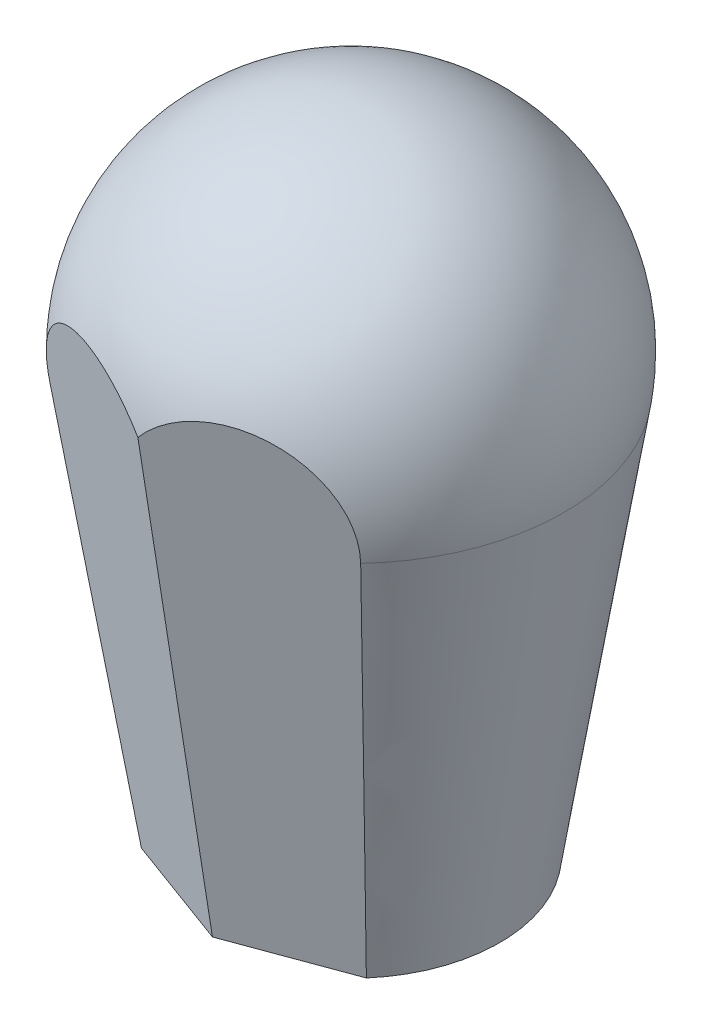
ISO-10303-21;
HEADER;
FILE_DESCRIPTION(('STEP AP214'),'2;1');
FILE_NAME('part.step','',(''),(''),'','','');
FILE_SCHEMA(('AUTOMOTIVE_DESIGN { 1 0 10303 214 1 1 1 1 }'));
ENDSEC;
DATA;
#1=APPLICATION_CONTEXT('core data for automotive mechanical design processes');
#2=APPLICATION_PROTOCOL_DEFINITION('international standard','automotive_design',2000,#1);
#3=PRODUCT_CONTEXT('',#1,'mechanical');
#4=PRODUCT('Part','Part','',(#3));
#5=PRODUCT_RELATED_PRODUCT_CATEGORY('part','',(#4));
#6=PRODUCT_DEFINITION_FORMATION('','',#4);
#7=PRODUCT_DEFINITION_CONTEXT('part definition',#1,'design');
#8=PRODUCT_DEFINITION('design','',#6,#7);
#9=PRODUCT_DEFINITION_SHAPE('','',#8);
#10=(LENGTH_UNIT() NAMED_UNIT(*) SI_UNIT(.MILLI.,.METRE.));
#11=(NAMED_UNIT(*) PLANE_ANGLE_UNIT() SI_UNIT($,.RADIAN.));
#12=(NAMED_UNIT(*) SI_UNIT($,.STERADIAN.) SOLID_ANGLE_UNIT());
#13=UNCERTAINTY_MEASURE_WITH_UNIT(LENGTH_MEASURE(1.E-05),#10,'distance_accuracy_value','');
#14=(GEOMETRIC_REPRESENTATION_CONTEXT(3) GLOBAL_UNCERTAINTY_ASSIGNED_CONTEXT((#13)) GLOBAL_UNIT_ASSIGNED_CONTEXT((#10,
#11,#12)) REPRESENTATION_CONTEXT('',''));
#15=CARTESIAN_POINT('',(0.,0.,0.));
#16=DIRECTION('',(0.,0.,1.));
#17=DIRECTION('',(1.,0.,0.));
#18=AXIS2_PLACEMENT_3D('',#15,#16,#17);
#19=CARTESIAN_POINT('',(0.,24.,0.));
#20=DIRECTION('',(0.,-1.,0.));
#21=DIRECTION('',(0.,0.,-1.));
#22=AXIS2_PLACEMENT_3D('',#19,#20,#21);
#23=PLANE('',#22);
#24=DIRECTION('',(0.938311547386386,0.,0.345791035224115));
#25=VECTOR('',#24,1.);
#26=CARTESIAN_POINT('',(-18.1535039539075,24.,49.259930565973));
#27=LINE('',#26,#25);
#28=CARTESIAN_POINT('',(-45.4115680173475,24.,39.2146591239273));
#29=VERTEX_POINT('',#28);
#30=CARTESIAN_POINT('',(0.,24.,55.9499462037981));
#31=VERTEX_POINT('',#30);
#32=EDGE_CURVE('E49',#29,#31,#27,.T.);
#33=ORIENTED_EDGE('',*,*,#32,.F.);
#34=CARTESIAN_POINT('',(0.,24.,0.));
#35=DIRECTION('',(0.,1.,0.));
#36=DIRECTION('',(0.,0.,1.));
#37=AXIS2_PLACEMENT_3D('',#34,#35,#36);
#38=CIRCLE('',#37,60.);
#39=CARTESIAN_POINT('',(45.4115680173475,24.,39.2146591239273));
#40=VERTEX_POINT('',#39);
#41=EDGE_CURVE('E89',#40,#29,#38,.T.);
#42=ORIENTED_EDGE('',*,*,#41,.F.);
#43=DIRECTION('',(0.938311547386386,0.,-0.345791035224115));
#44=VECTOR('',#43,1.);
#45=CARTESIAN_POINT('',(18.1535039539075,24.,49.259930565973));
#46=LINE('',#45,#44);
#47=EDGE_CURVE('E55',#31,#40,#46,.T.);
#48=ORIENTED_EDGE('',*,*,#47,.F.);
#49=EDGE_LOOP('',(#33,#42,#48));
#50=FACE_BOUND('',#49,.T.);
#51=CARTESIAN_POINT('',(0.,24.,0.));
#52=DIRECTION('',(0.,-1.,0.));
#53=DIRECTION('',(0.,0.,-1.));
#54=AXIS2_PLACEMENT_3D('',#51,#52,#53);
#55=CIRCLE('',#54,41.5692193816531);
#56=CARTESIAN_POINT('',(0.,24.,-41.5692193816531));
#57=VERTEX_POINT('',#56);
#58=EDGE_CURVE('E80',#57,#57,#55,.F.);
#59=ORIENTED_EDGE('',*,*,#58,.T.);
#60=EDGE_LOOP('',(#59));
#61=FACE_BOUND('',#60,.T.);
#62=ADVANCED_FACE('F34',(#50,#61),#23,.T.);
#63=CARTESIAN_POINT('',(0.,201.,0.));
#64=DIRECTION('',(0.,1.,0.));
#65=DIRECTION('',(-1.,0.,0.));
#66=AXIS2_PLACEMENT_3D('',#63,#64,#65);
#67=SPHERICAL_SURFACE('',#66,87.);
#68=CARTESIAN_POINT('',(-26.6756858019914,189.512994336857,72.3850576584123));
#69=DIRECTION('',(0.342020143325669,0.147279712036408,-0.928079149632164));
#70=DIRECTION('',(-0.938311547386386,0.,-0.345791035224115));
#71=AXIS2_PLACEMENT_3D('',#68,#69,#70);
#72=CIRCLE('',#71,38.5468535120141);
#73=CARTESIAN_POINT('',(0.,213.745792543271,86.0612849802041));
#74=VERTEX_POINT('',#73);
#75=CARTESIAN_POINT('',(-62.6765279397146,187.364333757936,58.7768785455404));
#76=VERTEX_POINT('',#75);
#77=EDGE_CURVE('E67',#74,#76,#72,.F.);
#78=ORIENTED_EDGE('',*,*,#77,.F.);
#79=CARTESIAN_POINT('',(26.6756858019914,189.512994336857,72.3850576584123));
#80=DIRECTION('',(-0.342020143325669,0.147279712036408,-0.928079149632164));
#81=DIRECTION('',(-0.938311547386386,0.,0.345791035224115));
#82=AXIS2_PLACEMENT_3D('',#79,#80,#81);
#83=CIRCLE('',#82,38.5468535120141);
#84=CARTESIAN_POINT('',(62.6765279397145,187.364333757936,58.7768785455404));
#85=VERTEX_POINT('',#84);
#86=EDGE_CURVE('E73',#85,#74,#83,.F.);
#87=ORIENTED_EDGE('',*,*,#86,.F.);
#88=CARTESIAN_POINT('',(0.,187.364333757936,0.));
#89=DIRECTION('',(0.,1.,0.));
#90=DIRECTION('',(0.,0.,1.));
#91=AXIS2_PLACEMENT_3D('',#88,#89,#90);
#92=CIRCLE('',#91,85.9247845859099);
#93=EDGE_CURVE('E75',#85,#76,#92,.T.);
#94=ORIENTED_EDGE('',*,*,#93,.T.);
#95=EDGE_LOOP('',(#78,#87,#94));
#96=FACE_BOUND('',#95,.T.);
#97=ADVANCED_FACE('F36',(#96),#67,.T.);
#98=CARTESIAN_POINT('',(0.,187.364333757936,0.));
#99=DIRECTION('',(0.,1.,0.));
#100=DIRECTION('',(0.,0.,1.));
#101=AXIS2_PLACEMENT_3D('',#98,#99,#100);
#102=CONICAL_SURFACE('',#101,85.9247845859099,0.157380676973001);
#103=CARTESIAN_POINT('',(-62.6765489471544,187.364533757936,58.776902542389));
#104=CARTESIAN_POINT('',(-61.3923479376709,175.13860130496,57.3099918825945));
#105=CARTESIAN_POINT('',(-60.1068573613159,162.912745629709,55.8435686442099));
#106=CARTESIAN_POINT('',(-57.5327092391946,138.461223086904,52.9119192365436));
#107=CARTESIAN_POINT('',(-56.2440516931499,126.235556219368,51.4466930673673));
#108=CARTESIAN_POINT('',(-53.6629824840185,101.784453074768,48.5176608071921));
#109=CARTESIAN_POINT('',(-52.3705708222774,89.5590167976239,47.0538547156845));
#110=CARTESIAN_POINT('',(-49.7811975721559,65.1084204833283,44.1279631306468));
#111=CARTESIAN_POINT('',(-48.4842359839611,52.8832604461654,42.6658776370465));
#112=CARTESIAN_POINT('',(-46.8892882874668,37.8818412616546,40.8730343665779));
#113=CARTESIAN_POINT('',(-46.5939545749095,35.1054199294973,40.5412733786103));
#114=CARTESIAN_POINT('',(-46.0029828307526,29.5525957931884,39.877866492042));
#115=CARTESIAN_POINT('',(-45.7073447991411,26.7761929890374,39.5462205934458));
#116=CARTESIAN_POINT('',(-45.4115467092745,23.9998,39.2146352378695));
#117=B_SPLINE_CURVE_WITH_KNOTS('',3,(#103,#104,#105,#106,#107,#108,#109,#110,#111,#112,#113,
#114,#115,#116),.UNSPECIFIED.,.F.,.F.,(4,2,2,2,2,2,4),(0.,37.1412146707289,74.2824326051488,
111.423637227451,148.564840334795,157.000018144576,165.435196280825),.UNSPECIFIED.);
#118=EDGE_CURVE('E78',#76,#29,#117,.T.);
#119=ORIENTED_EDGE('',*,*,#118,.F.);
#120=ORIENTED_EDGE('',*,*,#93,.F.);
#121=CARTESIAN_POINT('',(45.4115467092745,23.9998,39.2146352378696));
#122=CARTESIAN_POINT('',(46.3210073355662,32.5362092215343,40.2341453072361));
#123=CARTESIAN_POINT('',(47.2289806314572,41.072709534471,41.2542179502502));
#124=CARTESIAN_POINT('',(49.0423205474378,58.1458689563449,43.295349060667));
#125=CARTESIAN_POINT('',(49.9476871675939,66.6825280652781,44.3164075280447));
#126=CARTESIAN_POINT('',(52.6604287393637,92.2927061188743,47.3808523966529));
#127=CARTESIAN_POINT('',(54.4644457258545,109.366428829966,49.4255086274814));
#128=CARTESIAN_POINT('',(57.3358374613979,136.594253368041,52.6881962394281));
#129=CARTESIAN_POINT('',(58.4054321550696,146.748221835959,53.9053883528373));
#130=CARTESIAN_POINT('',(60.5425023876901,167.056286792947,56.3405738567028));
#131=CARTESIAN_POINT('',(61.6099779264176,177.21038328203,57.5585672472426));
#132=CARTESIAN_POINT('',(62.6765489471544,187.364533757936,58.7769025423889));
#133=B_SPLINE_CURVE_WITH_KNOTS('',3,(#121,#122,#123,#124,#125,#126,#127,#128,#129,#130,#131,
#132),.UNSPECIFIED.,.F.,.F.,(4,2,2,2,2,4),(0.,25.9351343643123,51.8702680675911,
103.740526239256,134.587859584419,165.43519615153),.UNSPECIFIED.);
#134=EDGE_CURVE('E42',#40,#85,#133,.T.);
#135=ORIENTED_EDGE('',*,*,#134,.F.);
#136=ORIENTED_EDGE('',*,*,#41,.T.);
#137=EDGE_LOOP('',(#119,#120,#135,#136));
#138=FACE_BOUND('',#137,.T.);
#139=ADVANCED_FACE('F98',(#138),#102,.T.);
#140=CARTESIAN_POINT('',(0.,0.,0.));
#141=DIRECTION('',(0.,-1.,0.));
#142=DIRECTION('',(-1.,0.,0.));
#143=AXIS2_PLACEMENT_3D('',#140,#141,#142);
#144=SPHERICAL_SURFACE('',#143,48.);
#145=ORIENTED_EDGE('',*,*,#58,.F.);
#146=EDGE_LOOP('',(#145));
#147=FACE_BOUND('',#146,.T.);
#148=ADVANCED_FACE('F104',(#147),#144,.F.);
#149=CARTESIAN_POINT('',(-38.5373941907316,16.3780766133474,68.9423837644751));
#150=DIRECTION('',(-0.342020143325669,0.147279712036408,-0.928079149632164));
#151=DIRECTION('',(-0.938311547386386,0.,0.345791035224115));
#152=AXIS2_PLACEMENT_3D('',#149,#150,#151);
#153=PLANE('',#152);
#154=ORIENTED_EDGE('',*,*,#86,.T.);
#155=DIRECTION('',(0.,-0.987641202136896,-0.156731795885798));
#156=VECTOR('',#155,1.);
#157=CARTESIAN_POINT('',(0.,18.5764695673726,55.0892696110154));
#158=LINE('',#157,#156);
#159=EDGE_CURVE('E11',#74,#31,#158,.T.);
#160=ORIENTED_EDGE('',*,*,#159,.T.);
#161=ORIENTED_EDGE('',*,*,#47,.T.);
#162=ORIENTED_EDGE('',*,*,#134,.T.);
#163=EDGE_LOOP('',(#154,#160,#161,#162));
#164=FACE_BOUND('',#163,.T.);
#165=ADVANCED_FACE('F77',(#164),#153,.F.);
#166=CARTESIAN_POINT('',(38.5373941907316,16.3780766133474,68.9423837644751));
#167=DIRECTION('',(0.342020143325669,0.147279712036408,-0.928079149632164));
#168=DIRECTION('',(0.938311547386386,0.,0.345791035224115));
#169=AXIS2_PLACEMENT_3D('',#166,#167,#168);
#170=PLANE('',#169);
#171=ORIENTED_EDGE('',*,*,#118,.T.);
#172=ORIENTED_EDGE('',*,*,#32,.T.);
#173=ORIENTED_EDGE('',*,*,#159,.F.);
#174=ORIENTED_EDGE('',*,*,#77,.T.);
#175=EDGE_LOOP('',(#171,#172,#173,#174));
#176=FACE_BOUND('',#175,.T.);
#177=ADVANCED_FACE('F66',(#176),#170,.F.);
#178=CLOSED_SHELL('',(#62,#97,#139,#148,#165,#177));
#179=MANIFOLD_SOLID_BREP('B2',#178);
#180=ADVANCED_BREP_SHAPE_REPRESENTATION('',(#18,#179),#14);
#181=SHAPE_DEFINITION_REPRESENTATION(#9,#180);
ENDSEC;
END-ISO-10303-21;
